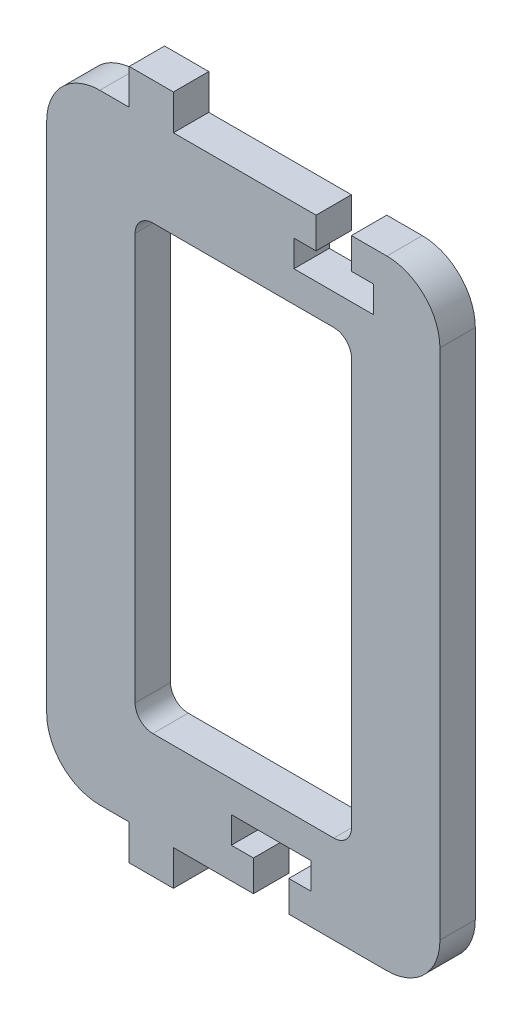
ISO-10303-21;
HEADER;
FILE_DESCRIPTION(('STEP AP214'),'2;1');
FILE_NAME('part.step','',(''),(''),'','','');
FILE_SCHEMA(('AUTOMOTIVE_DESIGN { 1 0 10303 214 1 1 1 1 }'));
ENDSEC;
DATA;
#1=APPLICATION_CONTEXT('core data for automotive mechanical design processes');
#2=APPLICATION_PROTOCOL_DEFINITION('international standard','automotive_design',2000,#1);
#3=PRODUCT_CONTEXT('',#1,'mechanical');
#4=PRODUCT('Part','Part','',(#3));
#5=PRODUCT_RELATED_PRODUCT_CATEGORY('part','',(#4));
#6=PRODUCT_DEFINITION_FORMATION('','',#4);
#7=PRODUCT_DEFINITION_CONTEXT('part definition',#1,'design');
#8=PRODUCT_DEFINITION('design','',#6,#7);
#9=PRODUCT_DEFINITION_SHAPE('','',#8);
#10=(LENGTH_UNIT() NAMED_UNIT(*) SI_UNIT(.MILLI.,.METRE.));
#11=(NAMED_UNIT(*) PLANE_ANGLE_UNIT() SI_UNIT($,.RADIAN.));
#12=(NAMED_UNIT(*) SI_UNIT($,.STERADIAN.) SOLID_ANGLE_UNIT());
#13=UNCERTAINTY_MEASURE_WITH_UNIT(LENGTH_MEASURE(1.E-05),#10,'distance_accuracy_value','');
#14=(GEOMETRIC_REPRESENTATION_CONTEXT(3) GLOBAL_UNCERTAINTY_ASSIGNED_CONTEXT((#13)) GLOBAL_UNIT_ASSIGNED_CONTEXT((#10,
#11,#12)) REPRESENTATION_CONTEXT('',''));
#15=CARTESIAN_POINT('',(0.,0.,0.));
#16=DIRECTION('',(0.,0.,1.));
#17=DIRECTION('',(1.,0.,0.));
#18=AXIS2_PLACEMENT_3D('',#15,#16,#17);
#19=CARTESIAN_POINT('',(-19.2252118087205,-14.8541333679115,4.));
#20=DIRECTION('',(0.,0.,1.));
#21=DIRECTION('',(1.,0.,0.));
#22=AXIS2_PLACEMENT_3D('',#19,#20,#21);
#23=PLANE('',#22);
#24=DIRECTION('',(0.,-1.,0.));
#25=VECTOR('',#24,1.);
#26=CARTESIAN_POINT('',(-48.3652118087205,-20.8541333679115,4.));
#27=LINE('',#26,#25);
#28=CARTESIAN_POINT('',(-48.3652118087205,-20.8541333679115,4.));
#29=VERTEX_POINT('',#28);
#30=CARTESIAN_POINT('',(-48.3652118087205,-24.8541333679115,4.));
#31=VERTEX_POINT('',#30);
#32=EDGE_CURVE('E354',#29,#31,#27,.T.);
#33=ORIENTED_EDGE('',*,*,#32,.T.);
#34=DIRECTION('',(1.,0.,0.));
#35=VECTOR('',#34,1.);
#36=CARTESIAN_POINT('',(-48.3652118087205,-24.8541333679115,4.));
#37=LINE('',#36,#35);
#38=CARTESIAN_POINT('',(-43.3652118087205,-24.8541333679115,4.));
#39=VERTEX_POINT('',#38);
#40=EDGE_CURVE('E357',#31,#39,#37,.T.);
#41=ORIENTED_EDGE('',*,*,#40,.T.);
#42=DIRECTION('',(0.,1.,0.));
#43=VECTOR('',#42,1.);
#44=CARTESIAN_POINT('',(-43.3652118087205,-24.8541333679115,4.));
#45=LINE('',#44,#43);
#46=CARTESIAN_POINT('',(-43.3652118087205,-20.8541333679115,4.));
#47=VERTEX_POINT('',#46);
#48=EDGE_CURVE('E360',#39,#47,#45,.T.);
#49=ORIENTED_EDGE('',*,*,#48,.T.);
#50=DIRECTION('',(1.,0.,0.));
#51=VECTOR('',#50,1.);
#52=CARTESIAN_POINT('',(-43.3652118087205,-20.8541333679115,4.));
#53=LINE('',#52,#51);
#54=CARTESIAN_POINT('',(-34.3152118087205,-20.8541333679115,4.));
#55=VERTEX_POINT('',#54);
#56=EDGE_CURVE('E362',#47,#55,#53,.T.);
#57=ORIENTED_EDGE('',*,*,#56,.T.);
#58=DIRECTION('',(0.,1.,0.));
#59=VECTOR('',#58,1.);
#60=CARTESIAN_POINT('',(-34.3152118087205,-20.8541333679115,4.));
#61=LINE('',#60,#59);
#62=CARTESIAN_POINT('',(-34.3152118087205,-17.3541333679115,4.));
#63=VERTEX_POINT('',#62);
#64=EDGE_CURVE('E364',#55,#63,#61,.T.);
#65=ORIENTED_EDGE('',*,*,#64,.T.);
#66=DIRECTION('',(-1.,0.,0.));
#67=VECTOR('',#66,1.);
#68=CARTESIAN_POINT('',(-34.3152118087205,-17.3541333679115,4.));
#69=LINE('',#68,#67);
#70=CARTESIAN_POINT('',(-36.8152118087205,-17.3541333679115,4.));
#71=VERTEX_POINT('',#70);
#72=EDGE_CURVE('E366',#63,#71,#69,.T.);
#73=ORIENTED_EDGE('',*,*,#72,.T.);
#74=DIRECTION('',(0.,1.,0.));
#75=VECTOR('',#74,1.);
#76=CARTESIAN_POINT('',(-36.8152118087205,-17.3541333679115,4.));
#77=LINE('',#76,#75);
#78=CARTESIAN_POINT('',(-36.8152118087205,-14.3541333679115,4.));
#79=VERTEX_POINT('',#78);
#80=EDGE_CURVE('E368',#71,#79,#77,.T.);
#81=ORIENTED_EDGE('',*,*,#80,.T.);
#82=DIRECTION('',(1.,0.,0.));
#83=VECTOR('',#82,1.);
#84=CARTESIAN_POINT('',(-27.8152118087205,-14.3541333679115,4.));
#85=LINE('',#84,#83);
#86=CARTESIAN_POINT('',(-27.8152118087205,-14.3541333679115,4.));
#87=VERTEX_POINT('',#86);
#88=EDGE_CURVE('E370',#79,#87,#85,.T.);
#89=ORIENTED_EDGE('',*,*,#88,.T.);
#90=DIRECTION('',(0.,-1.,0.));
#91=VECTOR('',#90,1.);
#92=CARTESIAN_POINT('',(-27.8152118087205,-14.3541333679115,4.));
#93=LINE('',#92,#91);
#94=CARTESIAN_POINT('',(-27.8152118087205,-17.3541333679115,4.));
#95=VERTEX_POINT('',#94);
#96=EDGE_CURVE('E372',#87,#95,#93,.T.);
#97=ORIENTED_EDGE('',*,*,#96,.T.);
#98=DIRECTION('',(-1.,0.,0.));
#99=VECTOR('',#98,1.);
#100=CARTESIAN_POINT('',(-27.8152118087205,-17.3541333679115,4.));
#101=LINE('',#100,#99);
#102=CARTESIAN_POINT('',(-30.3152118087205,-17.3541333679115,4.));
#103=VERTEX_POINT('',#102);
#104=EDGE_CURVE('E374',#95,#103,#101,.T.);
#105=ORIENTED_EDGE('',*,*,#104,.T.);
#106=DIRECTION('',(0.,-1.,0.));
#107=VECTOR('',#106,1.);
#108=CARTESIAN_POINT('',(-30.3152118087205,-17.3541333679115,4.));
#109=LINE('',#108,#107);
#110=CARTESIAN_POINT('',(-30.3152118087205,-20.8541333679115,4.));
#111=VERTEX_POINT('',#110);
#112=EDGE_CURVE('E376',#103,#111,#109,.T.);
#113=ORIENTED_EDGE('',*,*,#112,.T.);
#114=DIRECTION('',(1.,0.,0.));
#115=VECTOR('',#114,1.);
#116=CARTESIAN_POINT('',(-30.3152118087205,-20.8541333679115,4.));
#117=LINE('',#116,#115);
#118=CARTESIAN_POINT('',(-19.2252118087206,-20.8541333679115,4.));
#119=VERTEX_POINT('',#118);
#120=EDGE_CURVE('E378',#111,#119,#117,.T.);
#121=ORIENTED_EDGE('',*,*,#120,.T.);
#122=CARTESIAN_POINT('',(-19.2252118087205,-14.8541333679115,4.));
#123=DIRECTION('',(0.,0.,1.));
#124=DIRECTION('',(1.,0.,0.));
#125=AXIS2_PLACEMENT_3D('',#122,#123,#124);
#126=CIRCLE('',#125,6.);
#127=CARTESIAN_POINT('',(-13.2252118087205,-14.8541333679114,4.));
#128=VERTEX_POINT('',#127);
#129=EDGE_CURVE('E380',#119,#128,#126,.T.);
#130=ORIENTED_EDGE('',*,*,#129,.T.);
#131=DIRECTION('',(0.,1.,0.));
#132=VECTOR('',#131,1.);
#133=CARTESIAN_POINT('',(-13.2252118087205,-14.8541333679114,4.));
#134=LINE('',#133,#132);
#135=CARTESIAN_POINT('',(-13.2252118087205,43.1458666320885,4.));
#136=VERTEX_POINT('',#135);
#137=EDGE_CURVE('E382',#128,#136,#134,.T.);
#138=ORIENTED_EDGE('',*,*,#137,.T.);
#139=CARTESIAN_POINT('',(-19.2252118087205,43.1458666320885,4.));
#140=DIRECTION('',(0.,0.,1.));
#141=DIRECTION('',(1.,0.,0.));
#142=AXIS2_PLACEMENT_3D('',#139,#140,#141);
#143=CIRCLE('',#142,6.);
#144=CARTESIAN_POINT('',(-19.2252118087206,49.1458666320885,4.));
#145=VERTEX_POINT('',#144);
#146=EDGE_CURVE('E384',#136,#145,#143,.T.);
#147=ORIENTED_EDGE('',*,*,#146,.T.);
#148=DIRECTION('',(-1.,0.,0.));
#149=VECTOR('',#148,1.);
#150=CARTESIAN_POINT('',(-23.2352118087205,49.1458666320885,4.));
#151=LINE('',#150,#149);
#152=CARTESIAN_POINT('',(-23.2352118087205,49.1458666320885,4.));
#153=VERTEX_POINT('',#152);
#154=EDGE_CURVE('E386',#145,#153,#151,.T.);
#155=ORIENTED_EDGE('',*,*,#154,.T.);
#156=DIRECTION('',(0.,-1.,0.));
#157=VECTOR('',#156,1.);
#158=CARTESIAN_POINT('',(-23.2352118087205,45.6458666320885,4.));
#159=LINE('',#158,#157);
#160=CARTESIAN_POINT('',(-23.2352118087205,45.6458666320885,4.));
#161=VERTEX_POINT('',#160);
#162=EDGE_CURVE('E388',#153,#161,#159,.T.);
#163=ORIENTED_EDGE('',*,*,#162,.T.);
#164=DIRECTION('',(1.,0.,0.));
#165=VECTOR('',#164,1.);
#166=CARTESIAN_POINT('',(-20.7352118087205,45.6458666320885,4.));
#167=LINE('',#166,#165);
#168=CARTESIAN_POINT('',(-20.7352118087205,45.6458666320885,4.));
#169=VERTEX_POINT('',#168);
#170=EDGE_CURVE('E390',#161,#169,#167,.T.);
#171=ORIENTED_EDGE('',*,*,#170,.T.);
#172=DIRECTION('',(0.,-1.,0.));
#173=VECTOR('',#172,1.);
#174=CARTESIAN_POINT('',(-20.7352118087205,42.6458666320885,4.));
#175=LINE('',#174,#173);
#176=CARTESIAN_POINT('',(-20.7352118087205,42.6458666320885,4.));
#177=VERTEX_POINT('',#176);
#178=EDGE_CURVE('E392',#169,#177,#175,.T.);
#179=ORIENTED_EDGE('',*,*,#178,.T.);
#180=DIRECTION('',(-1.,0.,0.));
#181=VECTOR('',#180,1.);
#182=CARTESIAN_POINT('',(-20.7352118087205,42.6458666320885,4.));
#183=LINE('',#182,#181);
#184=CARTESIAN_POINT('',(-29.7352118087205,42.6458666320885,4.));
#185=VERTEX_POINT('',#184);
#186=EDGE_CURVE('E394',#177,#185,#183,.T.);
#187=ORIENTED_EDGE('',*,*,#186,.T.);
#188=DIRECTION('',(0.,1.,0.));
#189=VECTOR('',#188,1.);
#190=CARTESIAN_POINT('',(-29.7352118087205,45.6458666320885,4.));
#191=LINE('',#190,#189);
#192=CARTESIAN_POINT('',(-29.7352118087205,45.6458666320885,4.));
#193=VERTEX_POINT('',#192);
#194=EDGE_CURVE('E396',#185,#193,#191,.T.);
#195=ORIENTED_EDGE('',*,*,#194,.T.);
#196=DIRECTION('',(1.,0.,0.));
#197=VECTOR('',#196,1.);
#198=CARTESIAN_POINT('',(-27.2352118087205,45.6458666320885,4.));
#199=LINE('',#198,#197);
#200=CARTESIAN_POINT('',(-27.2352118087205,45.6458666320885,4.));
#201=VERTEX_POINT('',#200);
#202=EDGE_CURVE('E398',#193,#201,#199,.T.);
#203=ORIENTED_EDGE('',*,*,#202,.T.);
#204=DIRECTION('',(0.,1.,0.));
#205=VECTOR('',#204,1.);
#206=CARTESIAN_POINT('',(-27.2352118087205,49.1458666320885,4.));
#207=LINE('',#206,#205);
#208=CARTESIAN_POINT('',(-27.2352118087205,49.1458666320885,4.));
#209=VERTEX_POINT('',#208);
#210=EDGE_CURVE('E400',#201,#209,#207,.T.);
#211=ORIENTED_EDGE('',*,*,#210,.T.);
#212=DIRECTION('',(-1.,0.,0.));
#213=VECTOR('',#212,1.);
#214=CARTESIAN_POINT('',(-43.3652118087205,49.1458666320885,4.));
#215=LINE('',#214,#213);
#216=CARTESIAN_POINT('',(-43.3652118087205,49.1458666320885,4.));
#217=VERTEX_POINT('',#216);
#218=EDGE_CURVE('E402',#209,#217,#215,.T.);
#219=ORIENTED_EDGE('',*,*,#218,.T.);
#220=DIRECTION('',(0.,1.,0.));
#221=VECTOR('',#220,1.);
#222=CARTESIAN_POINT('',(-43.3652118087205,53.1458666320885,4.));
#223=LINE('',#222,#221);
#224=CARTESIAN_POINT('',(-43.3652118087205,53.1458666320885,4.));
#225=VERTEX_POINT('',#224);
#226=EDGE_CURVE('E404',#217,#225,#223,.T.);
#227=ORIENTED_EDGE('',*,*,#226,.T.);
#228=DIRECTION('',(-1.,0.,0.));
#229=VECTOR('',#228,1.);
#230=CARTESIAN_POINT('',(-48.3652118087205,53.1458666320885,4.));
#231=LINE('',#230,#229);
#232=CARTESIAN_POINT('',(-48.3652118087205,53.1458666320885,4.));
#233=VERTEX_POINT('',#232);
#234=EDGE_CURVE('E406',#225,#233,#231,.T.);
#235=ORIENTED_EDGE('',*,*,#234,.T.);
#236=DIRECTION('',(0.,-1.,0.));
#237=VECTOR('',#236,1.);
#238=CARTESIAN_POINT('',(-48.3652118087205,49.1458666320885,4.));
#239=LINE('',#238,#237);
#240=CARTESIAN_POINT('',(-48.3652118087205,49.1458666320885,4.));
#241=VERTEX_POINT('',#240);
#242=EDGE_CURVE('E408',#233,#241,#239,.T.);
#243=ORIENTED_EDGE('',*,*,#242,.T.);
#244=DIRECTION('',(-1.,0.,0.));
#245=VECTOR('',#244,1.);
#246=CARTESIAN_POINT('',(-51.6952118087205,49.1458666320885,4.));
#247=LINE('',#246,#245);
#248=CARTESIAN_POINT('',(-51.6952118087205,49.1458666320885,4.));
#249=VERTEX_POINT('',#248);
#250=EDGE_CURVE('E410',#241,#249,#247,.T.);
#251=ORIENTED_EDGE('',*,*,#250,.T.);
#252=CARTESIAN_POINT('',(-51.6952118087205,43.1458666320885,4.));
#253=DIRECTION('',(0.,0.,1.));
#254=DIRECTION('',(-1.,0.,0.));
#255=AXIS2_PLACEMENT_3D('',#252,#253,#254);
#256=CIRCLE('',#255,6.);
#257=CARTESIAN_POINT('',(-57.6952118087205,43.1458666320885,4.));
#258=VERTEX_POINT('',#257);
#259=EDGE_CURVE('E412',#249,#258,#256,.T.);
#260=ORIENTED_EDGE('',*,*,#259,.T.);
#261=DIRECTION('',(0.,-1.,0.));
#262=VECTOR('',#261,1.);
#263=CARTESIAN_POINT('',(-57.6952118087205,-14.8541333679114,4.));
#264=LINE('',#263,#262);
#265=CARTESIAN_POINT('',(-57.6952118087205,-14.8541333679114,4.));
#266=VERTEX_POINT('',#265);
#267=EDGE_CURVE('E414',#258,#266,#264,.T.);
#268=ORIENTED_EDGE('',*,*,#267,.T.);
#269=CARTESIAN_POINT('',(-51.6952118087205,-14.8541333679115,4.));
#270=DIRECTION('',(0.,0.,1.));
#271=DIRECTION('',(-1.,0.,0.));
#272=AXIS2_PLACEMENT_3D('',#269,#270,#271);
#273=CIRCLE('',#272,6.);
#274=CARTESIAN_POINT('',(-51.6952118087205,-20.8541333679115,4.));
#275=VERTEX_POINT('',#274);
#276=EDGE_CURVE('E416',#266,#275,#273,.T.);
#277=ORIENTED_EDGE('',*,*,#276,.T.);
#278=DIRECTION('',(1.,0.,0.));
#279=VECTOR('',#278,1.);
#280=CARTESIAN_POINT('',(-48.3652118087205,-20.8541333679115,4.));
#281=LINE('',#280,#279);
#282=EDGE_CURVE('E418',#275,#29,#281,.T.);
#283=ORIENTED_EDGE('',*,*,#282,.T.);
#284=EDGE_LOOP('',(#33,#41,#49,#57,#65,#73,#81,#89,#97,#105,#113,#121,#130,#138,#147,#155,#163,
#171,#179,#187,#195,#203,#211,#219,#227,#235,#243,#251,#260,#268,#277,#283));
#285=FACE_BOUND('',#284,.T.);
#286=CARTESIAN_POINT('',(-45.6952118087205,-8.85413336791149,4.));
#287=DIRECTION('',(0.,0.,1.));
#288=DIRECTION('',(1.,0.,0.));
#289=AXIS2_PLACEMENT_3D('',#286,#287,#288);
#290=CIRCLE('',#289,2.);
#291=CARTESIAN_POINT('',(-47.6952118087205,-8.85413336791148,4.));
#292=VERTEX_POINT('',#291);
#293=CARTESIAN_POINT('',(-45.6952118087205,-10.8541333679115,4.));
#294=VERTEX_POINT('',#293);
#295=EDGE_CURVE('E295',#292,#294,#290,.T.);
#296=ORIENTED_EDGE('',*,*,#295,.F.);
#297=DIRECTION('',(0.,-1.,0.));
#298=VECTOR('',#297,1.);
#299=CARTESIAN_POINT('',(-47.6952118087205,37.1458666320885,4.));
#300=LINE('',#299,#298);
#301=CARTESIAN_POINT('',(-47.6952118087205,37.1458666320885,4.));
#302=VERTEX_POINT('',#301);
#303=EDGE_CURVE('E287',#302,#292,#300,.T.);
#304=ORIENTED_EDGE('',*,*,#303,.F.);
#305=CARTESIAN_POINT('',(-45.6952118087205,37.1458666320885,4.));
#306=DIRECTION('',(0.,0.,1.));
#307=DIRECTION('',(1.,0.,0.));
#308=AXIS2_PLACEMENT_3D('',#305,#306,#307);
#309=CIRCLE('',#308,2.);
#310=CARTESIAN_POINT('',(-45.6952118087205,39.1458666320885,4.));
#311=VERTEX_POINT('',#310);
#312=EDGE_CURVE('E321',#311,#302,#309,.T.);
#313=ORIENTED_EDGE('',*,*,#312,.F.);
#314=DIRECTION('',(-1.,0.,0.));
#315=VECTOR('',#314,1.);
#316=CARTESIAN_POINT('',(-25.2252118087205,39.1458666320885,4.));
#317=LINE('',#316,#315);
#318=CARTESIAN_POINT('',(-25.2252118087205,39.1458666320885,4.));
#319=VERTEX_POINT('',#318);
#320=EDGE_CURVE('E319',#319,#311,#317,.T.);
#321=ORIENTED_EDGE('',*,*,#320,.F.);
#322=CARTESIAN_POINT('',(-25.2252118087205,37.1458666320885,4.));
#323=DIRECTION('',(0.,0.,1.));
#324=DIRECTION('',(1.,0.,0.));
#325=AXIS2_PLACEMENT_3D('',#322,#323,#324);
#326=CIRCLE('',#325,2.);
#327=CARTESIAN_POINT('',(-23.2252118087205,37.1458666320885,4.));
#328=VERTEX_POINT('',#327);
#329=EDGE_CURVE('E317',#328,#319,#326,.T.);
#330=ORIENTED_EDGE('',*,*,#329,.F.);
#331=DIRECTION('',(0.,1.,0.));
#332=VECTOR('',#331,1.);
#333=CARTESIAN_POINT('',(-23.2252118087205,-8.85413336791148,4.));
#334=LINE('',#333,#332);
#335=CARTESIAN_POINT('',(-23.2252118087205,-8.85413336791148,4.));
#336=VERTEX_POINT('',#335);
#337=EDGE_CURVE('E315',#336,#328,#334,.T.);
#338=ORIENTED_EDGE('',*,*,#337,.F.);
#339=CARTESIAN_POINT('',(-25.2252118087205,-8.85413336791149,4.));
#340=DIRECTION('',(0.,0.,1.));
#341=DIRECTION('',(1.,0.,0.));
#342=AXIS2_PLACEMENT_3D('',#339,#340,#341);
#343=CIRCLE('',#342,2.);
#344=CARTESIAN_POINT('',(-25.2252118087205,-10.8541333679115,4.));
#345=VERTEX_POINT('',#344);
#346=EDGE_CURVE('E311',#345,#336,#343,.T.);
#347=ORIENTED_EDGE('',*,*,#346,.F.);
#348=DIRECTION('',(1.,0.,0.));
#349=VECTOR('',#348,1.);
#350=CARTESIAN_POINT('',(-45.6952118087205,-10.8541333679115,4.));
#351=LINE('',#350,#349);
#352=EDGE_CURVE('E309',#294,#345,#351,.T.);
#353=ORIENTED_EDGE('',*,*,#352,.F.);
#354=EDGE_LOOP('',(#296,#304,#313,#321,#330,#338,#347,#353));
#355=FACE_BOUND('',#354,.T.);
#356=ADVANCED_FACE('F32',(#285,#355),#23,.T.);
#357=CARTESIAN_POINT('',(-19.2252118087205,-14.8541333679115,0.));
#358=DIRECTION('',(0.,0.,1.));
#359=DIRECTION('',(1.,0.,0.));
#360=AXIS2_PLACEMENT_3D('',#357,#358,#359);
#361=PLANE('',#360);
#362=DIRECTION('',(0.,-1.,0.));
#363=VECTOR('',#362,1.);
#364=CARTESIAN_POINT('',(-48.3652118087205,-20.8541333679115,0.));
#365=LINE('',#364,#363);
#366=CARTESIAN_POINT('',(-48.3652118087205,-20.8541333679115,0.));
#367=VERTEX_POINT('',#366);
#368=CARTESIAN_POINT('',(-48.3652118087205,-24.8541333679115,0.));
#369=VERTEX_POINT('',#368);
#370=EDGE_CURVE('E304',#367,#369,#365,.T.);
#371=ORIENTED_EDGE('',*,*,#370,.F.);
#372=DIRECTION('',(1.,0.,0.));
#373=VECTOR('',#372,1.);
#374=CARTESIAN_POINT('',(-48.3652118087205,-20.8541333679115,0.));
#375=LINE('',#374,#373);
#376=CARTESIAN_POINT('',(-51.6952118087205,-20.8541333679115,0.));
#377=VERTEX_POINT('',#376);
#378=EDGE_CURVE('E358',#377,#367,#375,.T.);
#379=ORIENTED_EDGE('',*,*,#378,.F.);
#380=CARTESIAN_POINT('',(-51.6952118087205,-14.8541333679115,0.));
#381=DIRECTION('',(0.,0.,1.));
#382=DIRECTION('',(-1.,0.,0.));
#383=AXIS2_PLACEMENT_3D('',#380,#381,#382);
#384=CIRCLE('',#383,6.);
#385=CARTESIAN_POINT('',(-57.6952118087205,-14.8541333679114,0.));
#386=VERTEX_POINT('',#385);
#387=EDGE_CURVE('E481',#386,#377,#384,.T.);
#388=ORIENTED_EDGE('',*,*,#387,.F.);
#389=DIRECTION('',(0.,-1.,0.));
#390=VECTOR('',#389,1.);
#391=CARTESIAN_POINT('',(-57.6952118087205,-14.8541333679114,0.));
#392=LINE('',#391,#390);
#393=CARTESIAN_POINT('',(-57.6952118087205,43.1458666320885,0.));
#394=VERTEX_POINT('',#393);
#395=EDGE_CURVE('E479',#394,#386,#392,.T.);
#396=ORIENTED_EDGE('',*,*,#395,.F.);
#397=CARTESIAN_POINT('',(-51.6952118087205,43.1458666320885,0.));
#398=DIRECTION('',(0.,0.,1.));
#399=DIRECTION('',(-1.,0.,0.));
#400=AXIS2_PLACEMENT_3D('',#397,#398,#399);
#401=CIRCLE('',#400,6.);
#402=CARTESIAN_POINT('',(-51.6952118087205,49.1458666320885,0.));
#403=VERTEX_POINT('',#402);
#404=EDGE_CURVE('E477',#403,#394,#401,.T.);
#405=ORIENTED_EDGE('',*,*,#404,.F.);
#406=DIRECTION('',(-1.,0.,0.));
#407=VECTOR('',#406,1.);
#408=CARTESIAN_POINT('',(-51.6952118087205,49.1458666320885,0.));
#409=LINE('',#408,#407);
#410=CARTESIAN_POINT('',(-48.3652118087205,49.1458666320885,0.));
#411=VERTEX_POINT('',#410);
#412=EDGE_CURVE('E475',#411,#403,#409,.T.);
#413=ORIENTED_EDGE('',*,*,#412,.F.);
#414=DIRECTION('',(0.,-1.,0.));
#415=VECTOR('',#414,1.);
#416=CARTESIAN_POINT('',(-48.3652118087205,49.1458666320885,0.));
#417=LINE('',#416,#415);
#418=CARTESIAN_POINT('',(-48.3652118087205,53.1458666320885,0.));
#419=VERTEX_POINT('',#418);
#420=EDGE_CURVE('E473',#419,#411,#417,.T.);
#421=ORIENTED_EDGE('',*,*,#420,.F.);
#422=DIRECTION('',(-1.,0.,0.));
#423=VECTOR('',#422,1.);
#424=CARTESIAN_POINT('',(-48.3652118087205,53.1458666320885,0.));
#425=LINE('',#424,#423);
#426=CARTESIAN_POINT('',(-43.3652118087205,53.1458666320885,0.));
#427=VERTEX_POINT('',#426);
#428=EDGE_CURVE('E471',#427,#419,#425,.T.);
#429=ORIENTED_EDGE('',*,*,#428,.F.);
#430=DIRECTION('',(0.,1.,0.));
#431=VECTOR('',#430,1.);
#432=CARTESIAN_POINT('',(-43.3652118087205,53.1458666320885,0.));
#433=LINE('',#432,#431);
#434=CARTESIAN_POINT('',(-43.3652118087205,49.1458666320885,0.));
#435=VERTEX_POINT('',#434);
#436=EDGE_CURVE('E469',#435,#427,#433,.T.);
#437=ORIENTED_EDGE('',*,*,#436,.F.);
#438=DIRECTION('',(-1.,0.,0.));
#439=VECTOR('',#438,1.);
#440=CARTESIAN_POINT('',(-43.3652118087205,49.1458666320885,0.));
#441=LINE('',#440,#439);
#442=CARTESIAN_POINT('',(-27.2352118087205,49.1458666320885,0.));
#443=VERTEX_POINT('',#442);
#444=EDGE_CURVE('E467',#443,#435,#441,.T.);
#445=ORIENTED_EDGE('',*,*,#444,.F.);
#446=DIRECTION('',(0.,1.,0.));
#447=VECTOR('',#446,1.);
#448=CARTESIAN_POINT('',(-27.2352118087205,49.1458666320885,0.));
#449=LINE('',#448,#447);
#450=CARTESIAN_POINT('',(-27.2352118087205,45.6458666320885,0.));
#451=VERTEX_POINT('',#450);
#452=EDGE_CURVE('E465',#451,#443,#449,.T.);
#453=ORIENTED_EDGE('',*,*,#452,.F.);
#454=DIRECTION('',(1.,0.,0.));
#455=VECTOR('',#454,1.);
#456=CARTESIAN_POINT('',(-27.2352118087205,45.6458666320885,0.));
#457=LINE('',#456,#455);
#458=CARTESIAN_POINT('',(-29.7352118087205,45.6458666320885,0.));
#459=VERTEX_POINT('',#458);
#460=EDGE_CURVE('E463',#459,#451,#457,.T.);
#461=ORIENTED_EDGE('',*,*,#460,.F.);
#462=DIRECTION('',(0.,1.,0.));
#463=VECTOR('',#462,1.);
#464=CARTESIAN_POINT('',(-29.7352118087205,45.6458666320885,0.));
#465=LINE('',#464,#463);
#466=CARTESIAN_POINT('',(-29.7352118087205,42.6458666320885,0.));
#467=VERTEX_POINT('',#466);
#468=EDGE_CURVE('E461',#467,#459,#465,.T.);
#469=ORIENTED_EDGE('',*,*,#468,.F.);
#470=DIRECTION('',(-1.,0.,0.));
#471=VECTOR('',#470,1.);
#472=CARTESIAN_POINT('',(-20.7352118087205,42.6458666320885,0.));
#473=LINE('',#472,#471);
#474=CARTESIAN_POINT('',(-20.7352118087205,42.6458666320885,0.));
#475=VERTEX_POINT('',#474);
#476=EDGE_CURVE('E459',#475,#467,#473,.T.);
#477=ORIENTED_EDGE('',*,*,#476,.F.);
#478=DIRECTION('',(0.,-1.,0.));
#479=VECTOR('',#478,1.);
#480=CARTESIAN_POINT('',(-20.7352118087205,42.6458666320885,0.));
#481=LINE('',#480,#479);
#482=CARTESIAN_POINT('',(-20.7352118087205,45.6458666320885,0.));
#483=VERTEX_POINT('',#482);
#484=EDGE_CURVE('E457',#483,#475,#481,.T.);
#485=ORIENTED_EDGE('',*,*,#484,.F.);
#486=DIRECTION('',(1.,0.,0.));
#487=VECTOR('',#486,1.);
#488=CARTESIAN_POINT('',(-20.7352118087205,45.6458666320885,0.));
#489=LINE('',#488,#487);
#490=CARTESIAN_POINT('',(-23.2352118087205,45.6458666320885,0.));
#491=VERTEX_POINT('',#490);
#492=EDGE_CURVE('E455',#491,#483,#489,.T.);
#493=ORIENTED_EDGE('',*,*,#492,.F.);
#494=DIRECTION('',(0.,-1.,0.));
#495=VECTOR('',#494,1.);
#496=CARTESIAN_POINT('',(-23.2352118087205,45.6458666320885,0.));
#497=LINE('',#496,#495);
#498=CARTESIAN_POINT('',(-23.2352118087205,49.1458666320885,0.));
#499=VERTEX_POINT('',#498);
#500=EDGE_CURVE('E453',#499,#491,#497,.T.);
#501=ORIENTED_EDGE('',*,*,#500,.F.);
#502=DIRECTION('',(-1.,0.,0.));
#503=VECTOR('',#502,1.);
#504=CARTESIAN_POINT('',(-23.2352118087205,49.1458666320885,0.));
#505=LINE('',#504,#503);
#506=CARTESIAN_POINT('',(-19.2252118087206,49.1458666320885,0.));
#507=VERTEX_POINT('',#506);
#508=EDGE_CURVE('E451',#507,#499,#505,.T.);
#509=ORIENTED_EDGE('',*,*,#508,.F.);
#510=CARTESIAN_POINT('',(-19.2252118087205,43.1458666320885,0.));
#511=DIRECTION('',(0.,0.,1.));
#512=DIRECTION('',(1.,0.,0.));
#513=AXIS2_PLACEMENT_3D('',#510,#511,#512);
#514=CIRCLE('',#513,6.);
#515=CARTESIAN_POINT('',(-13.2252118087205,43.1458666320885,0.));
#516=VERTEX_POINT('',#515);
#517=EDGE_CURVE('E449',#516,#507,#514,.T.);
#518=ORIENTED_EDGE('',*,*,#517,.F.);
#519=DIRECTION('',(0.,1.,0.));
#520=VECTOR('',#519,1.);
#521=CARTESIAN_POINT('',(-13.2252118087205,-14.8541333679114,0.));
#522=LINE('',#521,#520);
#523=CARTESIAN_POINT('',(-13.2252118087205,-14.8541333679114,0.));
#524=VERTEX_POINT('',#523);
#525=EDGE_CURVE('E447',#524,#516,#522,.T.);
#526=ORIENTED_EDGE('',*,*,#525,.F.);
#527=CARTESIAN_POINT('',(-19.2252118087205,-14.8541333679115,0.));
#528=DIRECTION('',(0.,0.,1.));
#529=DIRECTION('',(1.,0.,0.));
#530=AXIS2_PLACEMENT_3D('',#527,#528,#529);
#531=CIRCLE('',#530,6.);
#532=CARTESIAN_POINT('',(-19.2252118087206,-20.8541333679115,0.));
#533=VERTEX_POINT('',#532);
#534=EDGE_CURVE('E445',#533,#524,#531,.T.);
#535=ORIENTED_EDGE('',*,*,#534,.F.);
#536=DIRECTION('',(1.,0.,0.));
#537=VECTOR('',#536,1.);
#538=CARTESIAN_POINT('',(-30.3152118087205,-20.8541333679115,0.));
#539=LINE('',#538,#537);
#540=CARTESIAN_POINT('',(-30.3152118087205,-20.8541333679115,0.));
#541=VERTEX_POINT('',#540);
#542=EDGE_CURVE('E443',#541,#533,#539,.T.);
#543=ORIENTED_EDGE('',*,*,#542,.F.);
#544=DIRECTION('',(0.,-1.,0.));
#545=VECTOR('',#544,1.);
#546=CARTESIAN_POINT('',(-30.3152118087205,-17.3541333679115,0.));
#547=LINE('',#546,#545);
#548=CARTESIAN_POINT('',(-30.3152118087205,-17.3541333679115,0.));
#549=VERTEX_POINT('',#548);
#550=EDGE_CURVE('E441',#549,#541,#547,.T.);
#551=ORIENTED_EDGE('',*,*,#550,.F.);
#552=DIRECTION('',(-1.,0.,0.));
#553=VECTOR('',#552,1.);
#554=CARTESIAN_POINT('',(-27.8152118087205,-17.3541333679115,0.));
#555=LINE('',#554,#553);
#556=CARTESIAN_POINT('',(-27.8152118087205,-17.3541333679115,0.));
#557=VERTEX_POINT('',#556);
#558=EDGE_CURVE('E439',#557,#549,#555,.T.);
#559=ORIENTED_EDGE('',*,*,#558,.F.);
#560=DIRECTION('',(0.,-1.,0.));
#561=VECTOR('',#560,1.);
#562=CARTESIAN_POINT('',(-27.8152118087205,-14.3541333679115,0.));
#563=LINE('',#562,#561);
#564=CARTESIAN_POINT('',(-27.8152118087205,-14.3541333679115,0.));
#565=VERTEX_POINT('',#564);
#566=EDGE_CURVE('E437',#565,#557,#563,.T.);
#567=ORIENTED_EDGE('',*,*,#566,.F.);
#568=DIRECTION('',(1.,0.,0.));
#569=VECTOR('',#568,1.);
#570=CARTESIAN_POINT('',(-27.8152118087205,-14.3541333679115,0.));
#571=LINE('',#570,#569);
#572=CARTESIAN_POINT('',(-36.8152118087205,-14.3541333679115,0.));
#573=VERTEX_POINT('',#572);
#574=EDGE_CURVE('E435',#573,#565,#571,.T.);
#575=ORIENTED_EDGE('',*,*,#574,.F.);
#576=DIRECTION('',(0.,1.,0.));
#577=VECTOR('',#576,1.);
#578=CARTESIAN_POINT('',(-36.8152118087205,-17.3541333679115,0.));
#579=LINE('',#578,#577);
#580=CARTESIAN_POINT('',(-36.8152118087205,-17.3541333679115,0.));
#581=VERTEX_POINT('',#580);
#582=EDGE_CURVE('E433',#581,#573,#579,.T.);
#583=ORIENTED_EDGE('',*,*,#582,.F.);
#584=DIRECTION('',(-1.,0.,0.));
#585=VECTOR('',#584,1.);
#586=CARTESIAN_POINT('',(-34.3152118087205,-17.3541333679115,0.));
#587=LINE('',#586,#585);
#588=CARTESIAN_POINT('',(-34.3152118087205,-17.3541333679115,0.));
#589=VERTEX_POINT('',#588);
#590=EDGE_CURVE('E431',#589,#581,#587,.T.);
#591=ORIENTED_EDGE('',*,*,#590,.F.);
#592=DIRECTION('',(0.,1.,0.));
#593=VECTOR('',#592,1.);
#594=CARTESIAN_POINT('',(-34.3152118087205,-20.8541333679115,0.));
#595=LINE('',#594,#593);
#596=CARTESIAN_POINT('',(-34.3152118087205,-20.8541333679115,0.));
#597=VERTEX_POINT('',#596);
#598=EDGE_CURVE('E429',#597,#589,#595,.T.);
#599=ORIENTED_EDGE('',*,*,#598,.F.);
#600=DIRECTION('',(1.,0.,0.));
#601=VECTOR('',#600,1.);
#602=CARTESIAN_POINT('',(-43.3652118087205,-20.8541333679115,0.));
#603=LINE('',#602,#601);
#604=CARTESIAN_POINT('',(-43.3652118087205,-20.8541333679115,0.));
#605=VERTEX_POINT('',#604);
#606=EDGE_CURVE('E427',#605,#597,#603,.T.);
#607=ORIENTED_EDGE('',*,*,#606,.F.);
#608=DIRECTION('',(0.,1.,0.));
#609=VECTOR('',#608,1.);
#610=CARTESIAN_POINT('',(-43.3652118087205,-24.8541333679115,0.));
#611=LINE('',#610,#609);
#612=CARTESIAN_POINT('',(-43.3652118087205,-24.8541333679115,0.));
#613=VERTEX_POINT('',#612);
#614=EDGE_CURVE('E425',#613,#605,#611,.T.);
#615=ORIENTED_EDGE('',*,*,#614,.F.);
#616=DIRECTION('',(1.,0.,0.));
#617=VECTOR('',#616,1.);
#618=CARTESIAN_POINT('',(-48.3652118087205,-24.8541333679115,0.));
#619=LINE('',#618,#617);
#620=EDGE_CURVE('E423',#369,#613,#619,.T.);
#621=ORIENTED_EDGE('',*,*,#620,.F.);
#622=EDGE_LOOP('',(#371,#379,#388,#396,#405,#413,#421,#429,#437,#445,#453,#461,#469,#477,#485,
#493,#501,#509,#518,#526,#535,#543,#551,#559,#567,#575,#583,#591,#599,#607,#615,#621));
#623=FACE_BOUND('',#622,.T.);
#624=DIRECTION('',(0.,-1.,0.));
#625=VECTOR('',#624,1.);
#626=CARTESIAN_POINT('',(-47.6952118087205,14.1458666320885,0.));
#627=LINE('',#626,#625);
#628=CARTESIAN_POINT('',(-47.6952118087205,37.1458666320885,0.));
#629=VERTEX_POINT('',#628);
#630=CARTESIAN_POINT('',(-47.6952118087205,-8.85413336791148,0.));
#631=VERTEX_POINT('',#630);
#632=EDGE_CURVE('E323',#629,#631,#627,.T.);
#633=ORIENTED_EDGE('',*,*,#632,.T.);
#634=CARTESIAN_POINT('',(-45.6952118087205,-8.85413336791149,0.));
#635=DIRECTION('',(0.,0.,1.));
#636=DIRECTION('',(1.,0.,0.));
#637=AXIS2_PLACEMENT_3D('',#634,#635,#636);
#638=CIRCLE('',#637,2.);
#639=CARTESIAN_POINT('',(-45.6952118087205,-10.8541333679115,0.));
#640=VERTEX_POINT('',#639);
#641=EDGE_CURVE('E302',#631,#640,#638,.T.);
#642=ORIENTED_EDGE('',*,*,#641,.T.);
#643=DIRECTION('',(1.,0.,0.));
#644=VECTOR('',#643,1.);
#645=CARTESIAN_POINT('',(-45.6952118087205,-10.8541333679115,0.));
#646=LINE('',#645,#644);
#647=CARTESIAN_POINT('',(-25.2252118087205,-10.8541333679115,0.));
#648=VERTEX_POINT('',#647);
#649=EDGE_CURVE('E326',#640,#648,#646,.T.);
#650=ORIENTED_EDGE('',*,*,#649,.T.);
#651=CARTESIAN_POINT('',(-25.2252118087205,-8.85413336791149,0.));
#652=DIRECTION('',(0.,0.,1.));
#653=DIRECTION('',(1.,0.,0.));
#654=AXIS2_PLACEMENT_3D('',#651,#652,#653);
#655=CIRCLE('',#654,2.);
#656=CARTESIAN_POINT('',(-23.2252118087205,-8.85413336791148,0.));
#657=VERTEX_POINT('',#656);
#658=EDGE_CURVE('E329',#648,#657,#655,.T.);
#659=ORIENTED_EDGE('',*,*,#658,.T.);
#660=DIRECTION('',(0.,1.,0.));
#661=VECTOR('',#660,1.);
#662=CARTESIAN_POINT('',(-23.2252118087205,-8.85413336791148,0.));
#663=LINE('',#662,#661);
#664=CARTESIAN_POINT('',(-23.2252118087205,37.1458666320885,0.));
#665=VERTEX_POINT('',#664);
#666=EDGE_CURVE('E332',#657,#665,#663,.T.);
#667=ORIENTED_EDGE('',*,*,#666,.T.);
#668=CARTESIAN_POINT('',(-25.2252118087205,37.1458666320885,0.));
#669=DIRECTION('',(0.,0.,1.));
#670=DIRECTION('',(1.,0.,0.));
#671=AXIS2_PLACEMENT_3D('',#668,#669,#670);
#672=CIRCLE('',#671,2.);
#673=CARTESIAN_POINT('',(-25.2252118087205,39.1458666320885,0.));
#674=VERTEX_POINT('',#673);
#675=EDGE_CURVE('E335',#665,#674,#672,.T.);
#676=ORIENTED_EDGE('',*,*,#675,.T.);
#677=DIRECTION('',(-1.,0.,0.));
#678=VECTOR('',#677,1.);
#679=CARTESIAN_POINT('',(-25.2252118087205,39.1458666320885,0.));
#680=LINE('',#679,#678);
#681=CARTESIAN_POINT('',(-45.6952118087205,39.1458666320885,0.));
#682=VERTEX_POINT('',#681);
#683=EDGE_CURVE('E338',#674,#682,#680,.T.);
#684=ORIENTED_EDGE('',*,*,#683,.T.);
#685=CARTESIAN_POINT('',(-45.6952118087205,37.1458666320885,0.));
#686=DIRECTION('',(0.,0.,1.));
#687=DIRECTION('',(1.,0.,0.));
#688=AXIS2_PLACEMENT_3D('',#685,#686,#687);
#689=CIRCLE('',#688,2.);
#690=EDGE_CURVE('E296',#682,#629,#689,.T.);
#691=ORIENTED_EDGE('',*,*,#690,.T.);
#692=EDGE_LOOP('',(#633,#642,#650,#659,#667,#676,#684,#691));
#693=FACE_BOUND('',#692,.T.);
#694=ADVANCED_FACE('F583',(#623,#693),#361,.F.);
#695=CARTESIAN_POINT('',(-48.3652118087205,-20.8541333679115,4.));
#696=DIRECTION('',(1.,0.,0.));
#697=DIRECTION('',(0.,0.,-1.));
#698=AXIS2_PLACEMENT_3D('',#695,#696,#697);
#699=PLANE('',#698);
#700=ORIENTED_EDGE('',*,*,#370,.T.);
#701=DIRECTION('',(0.,0.,-1.));
#702=VECTOR('',#701,1.);
#703=CARTESIAN_POINT('',(-48.3652118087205,-24.8541333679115,4.));
#704=LINE('',#703,#702);
#705=EDGE_CURVE('E11',#31,#369,#704,.T.);
#706=ORIENTED_EDGE('',*,*,#705,.F.);
#707=ORIENTED_EDGE('',*,*,#32,.F.);
#708=DIRECTION('',(0.,0.,-1.));
#709=VECTOR('',#708,1.);
#710=CARTESIAN_POINT('',(-48.3652118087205,-20.8541333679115,4.));
#711=LINE('',#710,#709);
#712=EDGE_CURVE('E420',#29,#367,#711,.T.);
#713=ORIENTED_EDGE('',*,*,#712,.T.);
#714=EDGE_LOOP('',(#700,#706,#707,#713));
#715=FACE_BOUND('',#714,.T.);
#716=ADVANCED_FACE('F34',(#715),#699,.F.);
#717=CARTESIAN_POINT('',(-48.3652118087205,-24.8541333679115,4.));
#718=DIRECTION('',(0.,1.,0.));
#719=DIRECTION('',(0.,0.,1.));
#720=AXIS2_PLACEMENT_3D('',#717,#718,#719);
#721=PLANE('',#720);
#722=ORIENTED_EDGE('',*,*,#620,.T.);
#723=DIRECTION('',(0.,0.,-1.));
#724=VECTOR('',#723,1.);
#725=CARTESIAN_POINT('',(-43.3652118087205,-24.8541333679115,4.));
#726=LINE('',#725,#724);
#727=EDGE_CURVE('E40',#39,#613,#726,.T.);
#728=ORIENTED_EDGE('',*,*,#727,.F.);
#729=ORIENTED_EDGE('',*,*,#40,.F.);
#730=ORIENTED_EDGE('',*,*,#705,.T.);
#731=EDGE_LOOP('',(#722,#728,#729,#730));
#732=FACE_BOUND('',#731,.T.);
#733=ADVANCED_FACE('F600',(#732),#721,.F.);
#734=CARTESIAN_POINT('',(-43.3652118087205,-24.8541333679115,4.));
#735=DIRECTION('',(-1.,0.,0.));
#736=DIRECTION('',(0.,0.,1.));
#737=AXIS2_PLACEMENT_3D('',#734,#735,#736);
#738=PLANE('',#737);
#739=ORIENTED_EDGE('',*,*,#614,.T.);
#740=DIRECTION('',(0.,0.,-1.));
#741=VECTOR('',#740,1.);
#742=CARTESIAN_POINT('',(-43.3652118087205,-20.8541333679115,4.));
#743=LINE('',#742,#741);
#744=EDGE_CURVE('E570',#47,#605,#743,.T.);
#745=ORIENTED_EDGE('',*,*,#744,.F.);
#746=ORIENTED_EDGE('',*,*,#48,.F.);
#747=ORIENTED_EDGE('',*,*,#727,.T.);
#748=EDGE_LOOP('',(#739,#745,#746,#747));
#749=FACE_BOUND('',#748,.T.);
#750=ADVANCED_FACE('F577',(#749),#738,.F.);
#751=CARTESIAN_POINT('',(-43.3652118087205,-20.8541333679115,4.));
#752=DIRECTION('',(0.,1.,0.));
#753=DIRECTION('',(0.,0.,1.));
#754=AXIS2_PLACEMENT_3D('',#751,#752,#753);
#755=PLANE('',#754);
#756=ORIENTED_EDGE('',*,*,#606,.T.);
#757=DIRECTION('',(0.,0.,-1.));
#758=VECTOR('',#757,1.);
#759=CARTESIAN_POINT('',(-34.3152118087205,-20.8541333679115,4.));
#760=LINE('',#759,#758);
#761=EDGE_CURVE('E567',#55,#597,#760,.T.);
#762=ORIENTED_EDGE('',*,*,#761,.F.);
#763=ORIENTED_EDGE('',*,*,#56,.F.);
#764=ORIENTED_EDGE('',*,*,#744,.T.);
#765=EDGE_LOOP('',(#756,#762,#763,#764));
#766=FACE_BOUND('',#765,.T.);
#767=ADVANCED_FACE('F589',(#766),#755,.F.);
#768=CARTESIAN_POINT('',(-34.3152118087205,-20.8541333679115,4.));
#769=DIRECTION('',(-1.,0.,0.));
#770=DIRECTION('',(0.,0.,1.));
#771=AXIS2_PLACEMENT_3D('',#768,#769,#770);
#772=PLANE('',#771);
#773=ORIENTED_EDGE('',*,*,#598,.T.);
#774=DIRECTION('',(0.,0.,-1.));
#775=VECTOR('',#774,1.);
#776=CARTESIAN_POINT('',(-34.3152118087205,-17.3541333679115,4.));
#777=LINE('',#776,#775);
#778=EDGE_CURVE('E564',#63,#589,#777,.T.);
#779=ORIENTED_EDGE('',*,*,#778,.F.);
#780=ORIENTED_EDGE('',*,*,#64,.F.);
#781=ORIENTED_EDGE('',*,*,#761,.T.);
#782=EDGE_LOOP('',(#773,#779,#780,#781));
#783=FACE_BOUND('',#782,.T.);
#784=ADVANCED_FACE('F593',(#783),#772,.F.);
#785=CARTESIAN_POINT('',(-34.3152118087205,-17.3541333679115,4.));
#786=DIRECTION('',(0.,-1.,0.));
#787=DIRECTION('',(0.,0.,-1.));
#788=AXIS2_PLACEMENT_3D('',#785,#786,#787);
#789=PLANE('',#788);
#790=ORIENTED_EDGE('',*,*,#590,.T.);
#791=DIRECTION('',(0.,0.,-1.));
#792=VECTOR('',#791,1.);
#793=CARTESIAN_POINT('',(-36.8152118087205,-17.3541333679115,4.));
#794=LINE('',#793,#792);
#795=EDGE_CURVE('E561',#71,#581,#794,.T.);
#796=ORIENTED_EDGE('',*,*,#795,.F.);
#797=ORIENTED_EDGE('',*,*,#72,.F.);
#798=ORIENTED_EDGE('',*,*,#778,.T.);
#799=EDGE_LOOP('',(#790,#796,#797,#798));
#800=FACE_BOUND('',#799,.T.);
#801=ADVANCED_FACE('F733',(#800),#789,.F.);
#802=CARTESIAN_POINT('',(-36.8152118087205,-17.3541333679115,4.));
#803=DIRECTION('',(-1.,0.,0.));
#804=DIRECTION('',(0.,0.,1.));
#805=AXIS2_PLACEMENT_3D('',#802,#803,#804);
#806=PLANE('',#805);
#807=ORIENTED_EDGE('',*,*,#582,.T.);
#808=DIRECTION('',(0.,0.,-1.));
#809=VECTOR('',#808,1.);
#810=CARTESIAN_POINT('',(-36.8152118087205,-14.3541333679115,4.));
#811=LINE('',#810,#809);
#812=EDGE_CURVE('E558',#79,#573,#811,.T.);
#813=ORIENTED_EDGE('',*,*,#812,.F.);
#814=ORIENTED_EDGE('',*,*,#80,.F.);
#815=ORIENTED_EDGE('',*,*,#795,.T.);
#816=EDGE_LOOP('',(#807,#813,#814,#815));
#817=FACE_BOUND('',#816,.T.);
#818=ADVANCED_FACE('F731',(#817),#806,.F.);
#819=CARTESIAN_POINT('',(-27.8152118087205,-14.3541333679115,4.));
#820=DIRECTION('',(0.,1.,0.));
#821=DIRECTION('',(0.,0.,1.));
#822=AXIS2_PLACEMENT_3D('',#819,#820,#821);
#823=PLANE('',#822);
#824=ORIENTED_EDGE('',*,*,#574,.T.);
#825=DIRECTION('',(0.,0.,-1.));
#826=VECTOR('',#825,1.);
#827=CARTESIAN_POINT('',(-27.8152118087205,-14.3541333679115,4.));
#828=LINE('',#827,#826);
#829=EDGE_CURVE('E555',#87,#565,#828,.T.);
#830=ORIENTED_EDGE('',*,*,#829,.F.);
#831=ORIENTED_EDGE('',*,*,#88,.F.);
#832=ORIENTED_EDGE('',*,*,#812,.T.);
#833=EDGE_LOOP('',(#824,#830,#831,#832));
#834=FACE_BOUND('',#833,.T.);
#835=ADVANCED_FACE('F726',(#834),#823,.F.);
#836=CARTESIAN_POINT('',(-27.8152118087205,-14.3541333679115,4.));
#837=DIRECTION('',(1.,0.,0.));
#838=DIRECTION('',(0.,0.,-1.));
#839=AXIS2_PLACEMENT_3D('',#836,#837,#838);
#840=PLANE('',#839);
#841=ORIENTED_EDGE('',*,*,#566,.T.);
#842=DIRECTION('',(0.,0.,-1.));
#843=VECTOR('',#842,1.);
#844=CARTESIAN_POINT('',(-27.8152118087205,-17.3541333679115,4.));
#845=LINE('',#844,#843);
#846=EDGE_CURVE('E552',#95,#557,#845,.T.);
#847=ORIENTED_EDGE('',*,*,#846,.F.);
#848=ORIENTED_EDGE('',*,*,#96,.F.);
#849=ORIENTED_EDGE('',*,*,#829,.T.);
#850=EDGE_LOOP('',(#841,#847,#848,#849));
#851=FACE_BOUND('',#850,.T.);
#852=ADVANCED_FACE('F721',(#851),#840,.F.);
#853=CARTESIAN_POINT('',(-27.8152118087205,-17.3541333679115,4.));
#854=DIRECTION('',(0.,-1.,0.));
#855=DIRECTION('',(0.,0.,-1.));
#856=AXIS2_PLACEMENT_3D('',#853,#854,#855);
#857=PLANE('',#856);
#858=ORIENTED_EDGE('',*,*,#558,.T.);
#859=DIRECTION('',(0.,0.,-1.));
#860=VECTOR('',#859,1.);
#861=CARTESIAN_POINT('',(-30.3152118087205,-17.3541333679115,4.));
#862=LINE('',#861,#860);
#863=EDGE_CURVE('E549',#103,#549,#862,.T.);
#864=ORIENTED_EDGE('',*,*,#863,.F.);
#865=ORIENTED_EDGE('',*,*,#104,.F.);
#866=ORIENTED_EDGE('',*,*,#846,.T.);
#867=EDGE_LOOP('',(#858,#864,#865,#866));
#868=FACE_BOUND('',#867,.T.);
#869=ADVANCED_FACE('F717',(#868),#857,.F.);
#870=CARTESIAN_POINT('',(-30.3152118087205,-17.3541333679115,4.));
#871=DIRECTION('',(1.,0.,0.));
#872=DIRECTION('',(0.,0.,-1.));
#873=AXIS2_PLACEMENT_3D('',#870,#871,#872);
#874=PLANE('',#873);
#875=ORIENTED_EDGE('',*,*,#550,.T.);
#876=DIRECTION('',(0.,0.,-1.));
#877=VECTOR('',#876,1.);
#878=CARTESIAN_POINT('',(-30.3152118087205,-20.8541333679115,4.));
#879=LINE('',#878,#877);
#880=EDGE_CURVE('E546',#111,#541,#879,.T.);
#881=ORIENTED_EDGE('',*,*,#880,.F.);
#882=ORIENTED_EDGE('',*,*,#112,.F.);
#883=ORIENTED_EDGE('',*,*,#863,.T.);
#884=EDGE_LOOP('',(#875,#881,#882,#883));
#885=FACE_BOUND('',#884,.T.);
#886=ADVANCED_FACE('F712',(#885),#874,.F.);
#887=CARTESIAN_POINT('',(-30.3152118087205,-20.8541333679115,4.));
#888=DIRECTION('',(0.,1.,0.));
#889=DIRECTION('',(0.,0.,1.));
#890=AXIS2_PLACEMENT_3D('',#887,#888,#889);
#891=PLANE('',#890);
#892=ORIENTED_EDGE('',*,*,#542,.T.);
#893=DIRECTION('',(0.,0.,-1.));
#894=VECTOR('',#893,1.);
#895=CARTESIAN_POINT('',(-19.2252118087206,-20.8541333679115,4.));
#896=LINE('',#895,#894);
#897=EDGE_CURVE('E543',#119,#533,#896,.T.);
#898=ORIENTED_EDGE('',*,*,#897,.F.);
#899=ORIENTED_EDGE('',*,*,#120,.F.);
#900=ORIENTED_EDGE('',*,*,#880,.T.);
#901=EDGE_LOOP('',(#892,#898,#899,#900));
#902=FACE_BOUND('',#901,.T.);
#903=ADVANCED_FACE('F706',(#902),#891,.F.);
#904=CARTESIAN_POINT('',(-19.2252118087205,-14.8541333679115,4.));
#905=DIRECTION('',(0.,0.,-1.));
#906=DIRECTION('',(-1.,0.,0.));
#907=AXIS2_PLACEMENT_3D('',#904,#905,#906);
#908=CYLINDRICAL_SURFACE('',#907,6.);
#909=ORIENTED_EDGE('',*,*,#534,.T.);
#910=DIRECTION('',(0.,0.,-1.));
#911=VECTOR('',#910,1.);
#912=CARTESIAN_POINT('',(-13.2252118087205,-14.8541333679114,4.));
#913=LINE('',#912,#911);
#914=EDGE_CURVE('E540',#128,#524,#913,.T.);
#915=ORIENTED_EDGE('',*,*,#914,.F.);
#916=ORIENTED_EDGE('',*,*,#129,.F.);
#917=ORIENTED_EDGE('',*,*,#897,.T.);
#918=EDGE_LOOP('',(#909,#915,#916,#917));
#919=FACE_BOUND('',#918,.T.);
#920=ADVANCED_FACE('F702',(#919),#908,.T.);
#921=CARTESIAN_POINT('',(-13.2252118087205,-14.8541333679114,4.));
#922=DIRECTION('',(-1.,0.,0.));
#923=DIRECTION('',(0.,0.,1.));
#924=AXIS2_PLACEMENT_3D('',#921,#922,#923);
#925=PLANE('',#924);
#926=ORIENTED_EDGE('',*,*,#525,.T.);
#927=DIRECTION('',(0.,0.,-1.));
#928=VECTOR('',#927,1.);
#929=CARTESIAN_POINT('',(-13.2252118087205,43.1458666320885,4.));
#930=LINE('',#929,#928);
#931=EDGE_CURVE('E537',#136,#516,#930,.T.);
#932=ORIENTED_EDGE('',*,*,#931,.F.);
#933=ORIENTED_EDGE('',*,*,#137,.F.);
#934=ORIENTED_EDGE('',*,*,#914,.T.);
#935=EDGE_LOOP('',(#926,#932,#933,#934));
#936=FACE_BOUND('',#935,.T.);
#937=ADVANCED_FACE('F697',(#936),#925,.F.);
#938=CARTESIAN_POINT('',(-19.2252118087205,43.1458666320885,4.));
#939=DIRECTION('',(0.,0.,-1.));
#940=DIRECTION('',(-1.,0.,0.));
#941=AXIS2_PLACEMENT_3D('',#938,#939,#940);
#942=CYLINDRICAL_SURFACE('',#941,6.);
#943=ORIENTED_EDGE('',*,*,#517,.T.);
#944=DIRECTION('',(0.,0.,-1.));
#945=VECTOR('',#944,1.);
#946=CARTESIAN_POINT('',(-19.2252118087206,49.1458666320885,4.));
#947=LINE('',#946,#945);
#948=EDGE_CURVE('E534',#145,#507,#947,.T.);
#949=ORIENTED_EDGE('',*,*,#948,.F.);
#950=ORIENTED_EDGE('',*,*,#146,.F.);
#951=ORIENTED_EDGE('',*,*,#931,.T.);
#952=EDGE_LOOP('',(#943,#949,#950,#951));
#953=FACE_BOUND('',#952,.T.);
#954=ADVANCED_FACE('F691',(#953),#942,.T.);
#955=CARTESIAN_POINT('',(-23.2352118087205,49.1458666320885,4.));
#956=DIRECTION('',(0.,-1.,0.));
#957=DIRECTION('',(0.,0.,-1.));
#958=AXIS2_PLACEMENT_3D('',#955,#956,#957);
#959=PLANE('',#958);
#960=ORIENTED_EDGE('',*,*,#508,.T.);
#961=DIRECTION('',(0.,0.,-1.));
#962=VECTOR('',#961,1.);
#963=CARTESIAN_POINT('',(-23.2352118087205,49.1458666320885,4.));
#964=LINE('',#963,#962);
#965=EDGE_CURVE('E531',#153,#499,#964,.T.);
#966=ORIENTED_EDGE('',*,*,#965,.F.);
#967=ORIENTED_EDGE('',*,*,#154,.F.);
#968=ORIENTED_EDGE('',*,*,#948,.T.);
#969=EDGE_LOOP('',(#960,#966,#967,#968));
#970=FACE_BOUND('',#969,.T.);
#971=ADVANCED_FACE('F687',(#970),#959,.F.);
#972=CARTESIAN_POINT('',(-23.2352118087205,45.6458666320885,4.));
#973=DIRECTION('',(1.,0.,0.));
#974=DIRECTION('',(0.,0.,-1.));
#975=AXIS2_PLACEMENT_3D('',#972,#973,#974);
#976=PLANE('',#975);
#977=ORIENTED_EDGE('',*,*,#500,.T.);
#978=DIRECTION('',(0.,0.,-1.));
#979=VECTOR('',#978,1.);
#980=CARTESIAN_POINT('',(-23.2352118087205,45.6458666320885,4.));
#981=LINE('',#980,#979);
#982=EDGE_CURVE('E528',#161,#491,#981,.T.);
#983=ORIENTED_EDGE('',*,*,#982,.F.);
#984=ORIENTED_EDGE('',*,*,#162,.F.);
#985=ORIENTED_EDGE('',*,*,#965,.T.);
#986=EDGE_LOOP('',(#977,#983,#984,#985));
#987=FACE_BOUND('',#986,.T.);
#988=ADVANCED_FACE('F682',(#987),#976,.F.);
#989=CARTESIAN_POINT('',(-20.7352118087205,45.6458666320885,4.));
#990=DIRECTION('',(0.,1.,0.));
#991=DIRECTION('',(0.,0.,1.));
#992=AXIS2_PLACEMENT_3D('',#989,#990,#991);
#993=PLANE('',#992);
#994=ORIENTED_EDGE('',*,*,#492,.T.);
#995=DIRECTION('',(0.,0.,-1.));
#996=VECTOR('',#995,1.);
#997=CARTESIAN_POINT('',(-20.7352118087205,45.6458666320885,4.));
#998=LINE('',#997,#996);
#999=EDGE_CURVE('E525',#169,#483,#998,.T.);
#1000=ORIENTED_EDGE('',*,*,#999,.F.);
#1001=ORIENTED_EDGE('',*,*,#170,.F.);
#1002=ORIENTED_EDGE('',*,*,#982,.T.);
#1003=EDGE_LOOP('',(#994,#1000,#1001,#1002));
#1004=FACE_BOUND('',#1003,.T.);
#1005=ADVANCED_FACE('F676',(#1004),#993,.F.);
#1006=CARTESIAN_POINT('',(-20.7352118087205,42.6458666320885,4.));
#1007=DIRECTION('',(1.,0.,0.));
#1008=DIRECTION('',(0.,0.,-1.));
#1009=AXIS2_PLACEMENT_3D('',#1006,#1007,#1008);
#1010=PLANE('',#1009);
#1011=ORIENTED_EDGE('',*,*,#484,.T.);
#1012=DIRECTION('',(0.,0.,-1.));
#1013=VECTOR('',#1012,1.);
#1014=CARTESIAN_POINT('',(-20.7352118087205,42.6458666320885,4.));
#1015=LINE('',#1014,#1013);
#1016=EDGE_CURVE('E522',#177,#475,#1015,.T.);
#1017=ORIENTED_EDGE('',*,*,#1016,.F.);
#1018=ORIENTED_EDGE('',*,*,#178,.F.);
#1019=ORIENTED_EDGE('',*,*,#999,.T.);
#1020=EDGE_LOOP('',(#1011,#1017,#1018,#1019));
#1021=FACE_BOUND('',#1020,.T.);
#1022=ADVANCED_FACE('F672',(#1021),#1010,.F.);
#1023=CARTESIAN_POINT('',(-20.7352118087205,42.6458666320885,4.));
#1024=DIRECTION('',(0.,-1.,0.));
#1025=DIRECTION('',(1.,0.,0.));
#1026=AXIS2_PLACEMENT_3D('',#1023,#1024,#1025);
#1027=PLANE('',#1026);
#1028=ORIENTED_EDGE('',*,*,#476,.T.);
#1029=DIRECTION('',(0.,0.,-1.));
#1030=VECTOR('',#1029,1.);
#1031=CARTESIAN_POINT('',(-29.7352118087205,42.6458666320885,4.));
#1032=LINE('',#1031,#1030);
#1033=EDGE_CURVE('E519',#185,#467,#1032,.T.);
#1034=ORIENTED_EDGE('',*,*,#1033,.F.);
#1035=ORIENTED_EDGE('',*,*,#186,.F.);
#1036=ORIENTED_EDGE('',*,*,#1016,.T.);
#1037=EDGE_LOOP('',(#1028,#1034,#1035,#1036));
#1038=FACE_BOUND('',#1037,.T.);
#1039=ADVANCED_FACE('F667',(#1038),#1027,.F.);
#1040=CARTESIAN_POINT('',(-29.7352118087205,45.6458666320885,4.));
#1041=DIRECTION('',(-1.,0.,0.));
#1042=DIRECTION('',(0.,0.,1.));
#1043=AXIS2_PLACEMENT_3D('',#1040,#1041,#1042);
#1044=PLANE('',#1043);
#1045=ORIENTED_EDGE('',*,*,#468,.T.);
#1046=DIRECTION('',(0.,0.,-1.));
#1047=VECTOR('',#1046,1.);
#1048=CARTESIAN_POINT('',(-29.7352118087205,45.6458666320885,4.));
#1049=LINE('',#1048,#1047);
#1050=EDGE_CURVE('E516',#193,#459,#1049,.T.);
#1051=ORIENTED_EDGE('',*,*,#1050,.F.);
#1052=ORIENTED_EDGE('',*,*,#194,.F.);
#1053=ORIENTED_EDGE('',*,*,#1033,.T.);
#1054=EDGE_LOOP('',(#1045,#1051,#1052,#1053));
#1055=FACE_BOUND('',#1054,.T.);
#1056=ADVANCED_FACE('F661',(#1055),#1044,.F.);
#1057=CARTESIAN_POINT('',(-27.2352118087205,45.6458666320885,4.));
#1058=DIRECTION('',(0.,1.,0.));
#1059=DIRECTION('',(-1.,0.,0.));
#1060=AXIS2_PLACEMENT_3D('',#1057,#1058,#1059);
#1061=PLANE('',#1060);
#1062=ORIENTED_EDGE('',*,*,#460,.T.);
#1063=DIRECTION('',(0.,0.,-1.));
#1064=VECTOR('',#1063,1.);
#1065=CARTESIAN_POINT('',(-27.2352118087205,45.6458666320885,4.));
#1066=LINE('',#1065,#1064);
#1067=EDGE_CURVE('E513',#201,#451,#1066,.T.);
#1068=ORIENTED_EDGE('',*,*,#1067,.F.);
#1069=ORIENTED_EDGE('',*,*,#202,.F.);
#1070=ORIENTED_EDGE('',*,*,#1050,.T.);
#1071=EDGE_LOOP('',(#1062,#1068,#1069,#1070));
#1072=FACE_BOUND('',#1071,.T.);
#1073=ADVANCED_FACE('F657',(#1072),#1061,.F.);
#1074=CARTESIAN_POINT('',(-27.2352118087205,49.1458666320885,4.));
#1075=DIRECTION('',(-1.,0.,0.));
#1076=DIRECTION('',(0.,0.,1.));
#1077=AXIS2_PLACEMENT_3D('',#1074,#1075,#1076);
#1078=PLANE('',#1077);
#1079=ORIENTED_EDGE('',*,*,#452,.T.);
#1080=DIRECTION('',(0.,0.,-1.));
#1081=VECTOR('',#1080,1.);
#1082=CARTESIAN_POINT('',(-27.2352118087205,49.1458666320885,4.));
#1083=LINE('',#1082,#1081);
#1084=EDGE_CURVE('E510',#209,#443,#1083,.T.);
#1085=ORIENTED_EDGE('',*,*,#1084,.F.);
#1086=ORIENTED_EDGE('',*,*,#210,.F.);
#1087=ORIENTED_EDGE('',*,*,#1067,.T.);
#1088=EDGE_LOOP('',(#1079,#1085,#1086,#1087));
#1089=FACE_BOUND('',#1088,.T.);
#1090=ADVANCED_FACE('F652',(#1089),#1078,.F.);
#1091=CARTESIAN_POINT('',(-43.3652118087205,49.1458666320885,4.));
#1092=DIRECTION('',(0.,-1.,0.));
#1093=DIRECTION('',(0.,0.,-1.));
#1094=AXIS2_PLACEMENT_3D('',#1091,#1092,#1093);
#1095=PLANE('',#1094);
#1096=ORIENTED_EDGE('',*,*,#444,.T.);
#1097=DIRECTION('',(0.,0.,-1.));
#1098=VECTOR('',#1097,1.);
#1099=CARTESIAN_POINT('',(-43.3652118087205,49.1458666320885,4.));
#1100=LINE('',#1099,#1098);
#1101=EDGE_CURVE('E507',#217,#435,#1100,.T.);
#1102=ORIENTED_EDGE('',*,*,#1101,.F.);
#1103=ORIENTED_EDGE('',*,*,#218,.F.);
#1104=ORIENTED_EDGE('',*,*,#1084,.T.);
#1105=EDGE_LOOP('',(#1096,#1102,#1103,#1104));
#1106=FACE_BOUND('',#1105,.T.);
#1107=ADVANCED_FACE('F646',(#1106),#1095,.F.);
#1108=CARTESIAN_POINT('',(-43.3652118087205,53.1458666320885,4.));
#1109=DIRECTION('',(-1.,0.,0.));
#1110=DIRECTION('',(0.,0.,1.));
#1111=AXIS2_PLACEMENT_3D('',#1108,#1109,#1110);
#1112=PLANE('',#1111);
#1113=ORIENTED_EDGE('',*,*,#436,.T.);
#1114=DIRECTION('',(0.,0.,-1.));
#1115=VECTOR('',#1114,1.);
#1116=CARTESIAN_POINT('',(-43.3652118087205,53.1458666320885,4.));
#1117=LINE('',#1116,#1115);
#1118=EDGE_CURVE('E504',#225,#427,#1117,.T.);
#1119=ORIENTED_EDGE('',*,*,#1118,.F.);
#1120=ORIENTED_EDGE('',*,*,#226,.F.);
#1121=ORIENTED_EDGE('',*,*,#1101,.T.);
#1122=EDGE_LOOP('',(#1113,#1119,#1120,#1121));
#1123=FACE_BOUND('',#1122,.T.);
#1124=ADVANCED_FACE('F642',(#1123),#1112,.F.);
#1125=CARTESIAN_POINT('',(-48.3652118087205,53.1458666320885,4.));
#1126=DIRECTION('',(0.,-1.,0.));
#1127=DIRECTION('',(0.,0.,-1.));
#1128=AXIS2_PLACEMENT_3D('',#1125,#1126,#1127);
#1129=PLANE('',#1128);
#1130=ORIENTED_EDGE('',*,*,#428,.T.);
#1131=DIRECTION('',(0.,0.,-1.));
#1132=VECTOR('',#1131,1.);
#1133=CARTESIAN_POINT('',(-48.3652118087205,53.1458666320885,4.));
#1134=LINE('',#1133,#1132);
#1135=EDGE_CURVE('E501',#233,#419,#1134,.T.);
#1136=ORIENTED_EDGE('',*,*,#1135,.F.);
#1137=ORIENTED_EDGE('',*,*,#234,.F.);
#1138=ORIENTED_EDGE('',*,*,#1118,.T.);
#1139=EDGE_LOOP('',(#1130,#1136,#1137,#1138));
#1140=FACE_BOUND('',#1139,.T.);
#1141=ADVANCED_FACE('F637',(#1140),#1129,.F.);
#1142=CARTESIAN_POINT('',(-48.3652118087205,49.1458666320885,4.));
#1143=DIRECTION('',(1.,0.,0.));
#1144=DIRECTION('',(0.,0.,-1.));
#1145=AXIS2_PLACEMENT_3D('',#1142,#1143,#1144);
#1146=PLANE('',#1145);
#1147=ORIENTED_EDGE('',*,*,#420,.T.);
#1148=DIRECTION('',(0.,0.,-1.));
#1149=VECTOR('',#1148,1.);
#1150=CARTESIAN_POINT('',(-48.3652118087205,49.1458666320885,4.));
#1151=LINE('',#1150,#1149);
#1152=EDGE_CURVE('E498',#241,#411,#1151,.T.);
#1153=ORIENTED_EDGE('',*,*,#1152,.F.);
#1154=ORIENTED_EDGE('',*,*,#242,.F.);
#1155=ORIENTED_EDGE('',*,*,#1135,.T.);
#1156=EDGE_LOOP('',(#1147,#1153,#1154,#1155));
#1157=FACE_BOUND('',#1156,.T.);
#1158=ADVANCED_FACE('F631',(#1157),#1146,.F.);
#1159=CARTESIAN_POINT('',(-51.6952118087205,49.1458666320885,4.));
#1160=DIRECTION('',(0.,-1.,0.));
#1161=DIRECTION('',(0.,0.,-1.));
#1162=AXIS2_PLACEMENT_3D('',#1159,#1160,#1161);
#1163=PLANE('',#1162);
#1164=ORIENTED_EDGE('',*,*,#412,.T.);
#1165=DIRECTION('',(0.,0.,-1.));
#1166=VECTOR('',#1165,1.);
#1167=CARTESIAN_POINT('',(-51.6952118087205,49.1458666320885,4.));
#1168=LINE('',#1167,#1166);
#1169=EDGE_CURVE('E495',#249,#403,#1168,.T.);
#1170=ORIENTED_EDGE('',*,*,#1169,.F.);
#1171=ORIENTED_EDGE('',*,*,#250,.F.);
#1172=ORIENTED_EDGE('',*,*,#1152,.T.);
#1173=EDGE_LOOP('',(#1164,#1170,#1171,#1172));
#1174=FACE_BOUND('',#1173,.T.);
#1175=ADVANCED_FACE('F627',(#1174),#1163,.F.);
#1176=CARTESIAN_POINT('',(-51.6952118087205,43.1458666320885,4.));
#1177=DIRECTION('',(0.,0.,-1.));
#1178=DIRECTION('',(-1.,0.,0.));
#1179=AXIS2_PLACEMENT_3D('',#1176,#1177,#1178);
#1180=CYLINDRICAL_SURFACE('',#1179,6.);
#1181=ORIENTED_EDGE('',*,*,#404,.T.);
#1182=DIRECTION('',(0.,0.,-1.));
#1183=VECTOR('',#1182,1.);
#1184=CARTESIAN_POINT('',(-57.6952118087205,43.1458666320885,4.));
#1185=LINE('',#1184,#1183);
#1186=EDGE_CURVE('E492',#258,#394,#1185,.T.);
#1187=ORIENTED_EDGE('',*,*,#1186,.F.);
#1188=ORIENTED_EDGE('',*,*,#259,.F.);
#1189=ORIENTED_EDGE('',*,*,#1169,.T.);
#1190=EDGE_LOOP('',(#1181,#1187,#1188,#1189));
#1191=FACE_BOUND('',#1190,.T.);
#1192=ADVANCED_FACE('F622',(#1191),#1180,.T.);
#1193=CARTESIAN_POINT('',(-57.6952118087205,-14.8541333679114,4.));
#1194=DIRECTION('',(1.,0.,0.));
#1195=DIRECTION('',(0.,0.,-1.));
#1196=AXIS2_PLACEMENT_3D('',#1193,#1194,#1195);
#1197=PLANE('',#1196);
#1198=ORIENTED_EDGE('',*,*,#395,.T.);
#1199=DIRECTION('',(0.,0.,-1.));
#1200=VECTOR('',#1199,1.);
#1201=CARTESIAN_POINT('',(-57.6952118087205,-14.8541333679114,4.));
#1202=LINE('',#1201,#1200);
#1203=EDGE_CURVE('E489',#266,#386,#1202,.T.);
#1204=ORIENTED_EDGE('',*,*,#1203,.F.);
#1205=ORIENTED_EDGE('',*,*,#267,.F.);
#1206=ORIENTED_EDGE('',*,*,#1186,.T.);
#1207=EDGE_LOOP('',(#1198,#1204,#1205,#1206));
#1208=FACE_BOUND('',#1207,.T.);
#1209=ADVANCED_FACE('F616',(#1208),#1197,.F.);
#1210=CARTESIAN_POINT('',(-51.6952118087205,-14.8541333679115,4.));
#1211=DIRECTION('',(0.,0.,-1.));
#1212=DIRECTION('',(-1.,0.,0.));
#1213=AXIS2_PLACEMENT_3D('',#1210,#1211,#1212);
#1214=CYLINDRICAL_SURFACE('',#1213,6.);
#1215=ORIENTED_EDGE('',*,*,#387,.T.);
#1216=DIRECTION('',(0.,0.,-1.));
#1217=VECTOR('',#1216,1.);
#1218=CARTESIAN_POINT('',(-51.6952118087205,-20.8541333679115,4.));
#1219=LINE('',#1218,#1217);
#1220=EDGE_CURVE('E486',#275,#377,#1219,.T.);
#1221=ORIENTED_EDGE('',*,*,#1220,.F.);
#1222=ORIENTED_EDGE('',*,*,#276,.F.);
#1223=ORIENTED_EDGE('',*,*,#1203,.T.);
#1224=EDGE_LOOP('',(#1215,#1221,#1222,#1223));
#1225=FACE_BOUND('',#1224,.T.);
#1226=ADVANCED_FACE('F612',(#1225),#1214,.T.);
#1227=CARTESIAN_POINT('',(-48.3652118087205,-20.8541333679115,4.));
#1228=DIRECTION('',(0.,1.,0.));
#1229=DIRECTION('',(0.,0.,1.));
#1230=AXIS2_PLACEMENT_3D('',#1227,#1228,#1229);
#1231=PLANE('',#1230);
#1232=ORIENTED_EDGE('',*,*,#378,.T.);
#1233=ORIENTED_EDGE('',*,*,#712,.F.);
#1234=ORIENTED_EDGE('',*,*,#282,.F.);
#1235=ORIENTED_EDGE('',*,*,#1220,.T.);
#1236=EDGE_LOOP('',(#1232,#1233,#1234,#1235));
#1237=FACE_BOUND('',#1236,.T.);
#1238=ADVANCED_FACE('F607',(#1237),#1231,.F.);
#1239=CARTESIAN_POINT('',(-47.6952118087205,14.1458666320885,4.));
#1240=DIRECTION('',(1.,0.,0.));
#1241=DIRECTION('',(0.,0.,-1.));
#1242=AXIS2_PLACEMENT_3D('',#1239,#1240,#1241);
#1243=PLANE('',#1242);
#1244=ORIENTED_EDGE('',*,*,#632,.F.);
#1245=DIRECTION('',(0.,0.,-1.));
#1246=VECTOR('',#1245,1.);
#1247=CARTESIAN_POINT('',(-47.6952118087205,37.1458666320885,4.));
#1248=LINE('',#1247,#1246);
#1249=EDGE_CURVE('E52',#302,#629,#1248,.T.);
#1250=ORIENTED_EDGE('',*,*,#1249,.F.);
#1251=ORIENTED_EDGE('',*,*,#303,.T.);
#1252=DIRECTION('',(0.,0.,-1.));
#1253=VECTOR('',#1252,1.);
#1254=CARTESIAN_POINT('',(-47.6952118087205,-8.85413336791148,4.));
#1255=LINE('',#1254,#1253);
#1256=EDGE_CURVE('E290',#292,#631,#1255,.T.);
#1257=ORIENTED_EDGE('',*,*,#1256,.T.);
#1258=EDGE_LOOP('',(#1244,#1250,#1251,#1257));
#1259=FACE_BOUND('',#1258,.T.);
#1260=ADVANCED_FACE('F289',(#1259),#1243,.T.);
#1261=CARTESIAN_POINT('',(-45.6952118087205,-8.85413336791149,4.));
#1262=DIRECTION('',(0.,0.,-1.));
#1263=DIRECTION('',(-1.,0.,0.));
#1264=AXIS2_PLACEMENT_3D('',#1261,#1262,#1263);
#1265=CYLINDRICAL_SURFACE('',#1264,2.);
#1266=ORIENTED_EDGE('',*,*,#641,.F.);
#1267=ORIENTED_EDGE('',*,*,#1256,.F.);
#1268=ORIENTED_EDGE('',*,*,#295,.T.);
#1269=DIRECTION('',(0.,0.,-1.));
#1270=VECTOR('',#1269,1.);
#1271=CARTESIAN_POINT('',(-45.6952118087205,-10.8541333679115,4.));
#1272=LINE('',#1271,#1270);
#1273=EDGE_CURVE('E305',#294,#640,#1272,.T.);
#1274=ORIENTED_EDGE('',*,*,#1273,.T.);
#1275=EDGE_LOOP('',(#1266,#1267,#1268,#1274));
#1276=FACE_BOUND('',#1275,.T.);
#1277=ADVANCED_FACE('F299',(#1276),#1265,.F.);
#1278=CARTESIAN_POINT('',(-45.6952118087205,-10.8541333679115,4.));
#1279=DIRECTION('',(0.,1.,0.));
#1280=DIRECTION('',(0.,0.,1.));
#1281=AXIS2_PLACEMENT_3D('',#1278,#1279,#1280);
#1282=PLANE('',#1281);
#1283=ORIENTED_EDGE('',*,*,#649,.F.);
#1284=ORIENTED_EDGE('',*,*,#1273,.F.);
#1285=ORIENTED_EDGE('',*,*,#352,.T.);
#1286=DIRECTION('',(0.,0.,-1.));
#1287=VECTOR('',#1286,1.);
#1288=CARTESIAN_POINT('',(-25.2252118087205,-10.8541333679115,4.));
#1289=LINE('',#1288,#1287);
#1290=EDGE_CURVE('E351',#345,#648,#1289,.T.);
#1291=ORIENTED_EDGE('',*,*,#1290,.T.);
#1292=EDGE_LOOP('',(#1283,#1284,#1285,#1291));
#1293=FACE_BOUND('',#1292,.T.);
#1294=ADVANCED_FACE('F911',(#1293),#1282,.T.);
#1295=CARTESIAN_POINT('',(-25.2252118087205,-8.85413336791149,4.));
#1296=DIRECTION('',(0.,0.,-1.));
#1297=DIRECTION('',(-1.,0.,0.));
#1298=AXIS2_PLACEMENT_3D('',#1295,#1296,#1297);
#1299=CYLINDRICAL_SURFACE('',#1298,2.);
#1300=ORIENTED_EDGE('',*,*,#658,.F.);
#1301=ORIENTED_EDGE('',*,*,#1290,.F.);
#1302=ORIENTED_EDGE('',*,*,#346,.T.);
#1303=DIRECTION('',(0.,0.,-1.));
#1304=VECTOR('',#1303,1.);
#1305=CARTESIAN_POINT('',(-23.2252118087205,-8.85413336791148,4.));
#1306=LINE('',#1305,#1304);
#1307=EDGE_CURVE('E349',#336,#657,#1306,.T.);
#1308=ORIENTED_EDGE('',*,*,#1307,.T.);
#1309=EDGE_LOOP('',(#1300,#1301,#1302,#1308));
#1310=FACE_BOUND('',#1309,.T.);
#1311=ADVANCED_FACE('F917',(#1310),#1299,.F.);
#1312=CARTESIAN_POINT('',(-23.2252118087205,-8.85413336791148,4.));
#1313=DIRECTION('',(-1.,0.,0.));
#1314=DIRECTION('',(0.,0.,1.));
#1315=AXIS2_PLACEMENT_3D('',#1312,#1313,#1314);
#1316=PLANE('',#1315);
#1317=ORIENTED_EDGE('',*,*,#666,.F.);
#1318=ORIENTED_EDGE('',*,*,#1307,.F.);
#1319=ORIENTED_EDGE('',*,*,#337,.T.);
#1320=DIRECTION('',(0.,0.,-1.));
#1321=VECTOR('',#1320,1.);
#1322=CARTESIAN_POINT('',(-23.2252118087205,37.1458666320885,4.));
#1323=LINE('',#1322,#1321);
#1324=EDGE_CURVE('E347',#328,#665,#1323,.T.);
#1325=ORIENTED_EDGE('',*,*,#1324,.T.);
#1326=EDGE_LOOP('',(#1317,#1318,#1319,#1325));
#1327=FACE_BOUND('',#1326,.T.);
#1328=ADVANCED_FACE('F925',(#1327),#1316,.T.);
#1329=CARTESIAN_POINT('',(-25.2252118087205,37.1458666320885,4.));
#1330=DIRECTION('',(0.,0.,-1.));
#1331=DIRECTION('',(-1.,0.,0.));
#1332=AXIS2_PLACEMENT_3D('',#1329,#1330,#1331);
#1333=CYLINDRICAL_SURFACE('',#1332,2.);
#1334=ORIENTED_EDGE('',*,*,#675,.F.);
#1335=ORIENTED_EDGE('',*,*,#1324,.F.);
#1336=ORIENTED_EDGE('',*,*,#329,.T.);
#1337=DIRECTION('',(0.,0.,-1.));
#1338=VECTOR('',#1337,1.);
#1339=CARTESIAN_POINT('',(-25.2252118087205,39.1458666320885,4.));
#1340=LINE('',#1339,#1338);
#1341=EDGE_CURVE('E345',#319,#674,#1340,.T.);
#1342=ORIENTED_EDGE('',*,*,#1341,.T.);
#1343=EDGE_LOOP('',(#1334,#1335,#1336,#1342));
#1344=FACE_BOUND('',#1343,.T.);
#1345=ADVANCED_FACE('F933',(#1344),#1333,.F.);
#1346=CARTESIAN_POINT('',(-25.2252118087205,39.1458666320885,4.));
#1347=DIRECTION('',(0.,-1.,0.));
#1348=DIRECTION('',(0.,0.,-1.));
#1349=AXIS2_PLACEMENT_3D('',#1346,#1347,#1348);
#1350=PLANE('',#1349);
#1351=ORIENTED_EDGE('',*,*,#683,.F.);
#1352=ORIENTED_EDGE('',*,*,#1341,.F.);
#1353=ORIENTED_EDGE('',*,*,#320,.T.);
#1354=DIRECTION('',(0.,0.,-1.));
#1355=VECTOR('',#1354,1.);
#1356=CARTESIAN_POINT('',(-45.6952118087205,39.1458666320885,4.));
#1357=LINE('',#1356,#1355);
#1358=EDGE_CURVE('E47',#311,#682,#1357,.T.);
#1359=ORIENTED_EDGE('',*,*,#1358,.T.);
#1360=EDGE_LOOP('',(#1351,#1352,#1353,#1359));
#1361=FACE_BOUND('',#1360,.T.);
#1362=ADVANCED_FACE('F941',(#1361),#1350,.T.);
#1363=CARTESIAN_POINT('',(-45.6952118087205,37.1458666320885,4.));
#1364=DIRECTION('',(0.,0.,-1.));
#1365=DIRECTION('',(-1.,0.,0.));
#1366=AXIS2_PLACEMENT_3D('',#1363,#1364,#1365);
#1367=CYLINDRICAL_SURFACE('',#1366,2.);
#1368=ORIENTED_EDGE('',*,*,#690,.F.);
#1369=ORIENTED_EDGE('',*,*,#1358,.F.);
#1370=ORIENTED_EDGE('',*,*,#312,.T.);
#1371=ORIENTED_EDGE('',*,*,#1249,.T.);
#1372=EDGE_LOOP('',(#1368,#1369,#1370,#1371));
#1373=FACE_BOUND('',#1372,.T.);
#1374=ADVANCED_FACE('F949',(#1373),#1367,.F.);
#1375=CLOSED_SHELL('',(#356,#694,#716,#733,#750,#767,#784,#801,#818,#835,#852,#869,#886,#903,
#920,#937,#954,#971,#988,#1005,#1022,#1039,#1056,#1073,#1090,#1107,#1124,#1141,#1158,#1175,
#1192,#1209,#1226,#1238,#1260,#1277,#1294,#1311,#1328,#1345,#1362,#1374));
#1376=MANIFOLD_SOLID_BREP('B2',#1375);
#1377=ADVANCED_BREP_SHAPE_REPRESENTATION('',(#18,#1376),#14);
#1378=SHAPE_DEFINITION_REPRESENTATION(#9,#1377);
ENDSEC;
END-ISO-10303-21;
